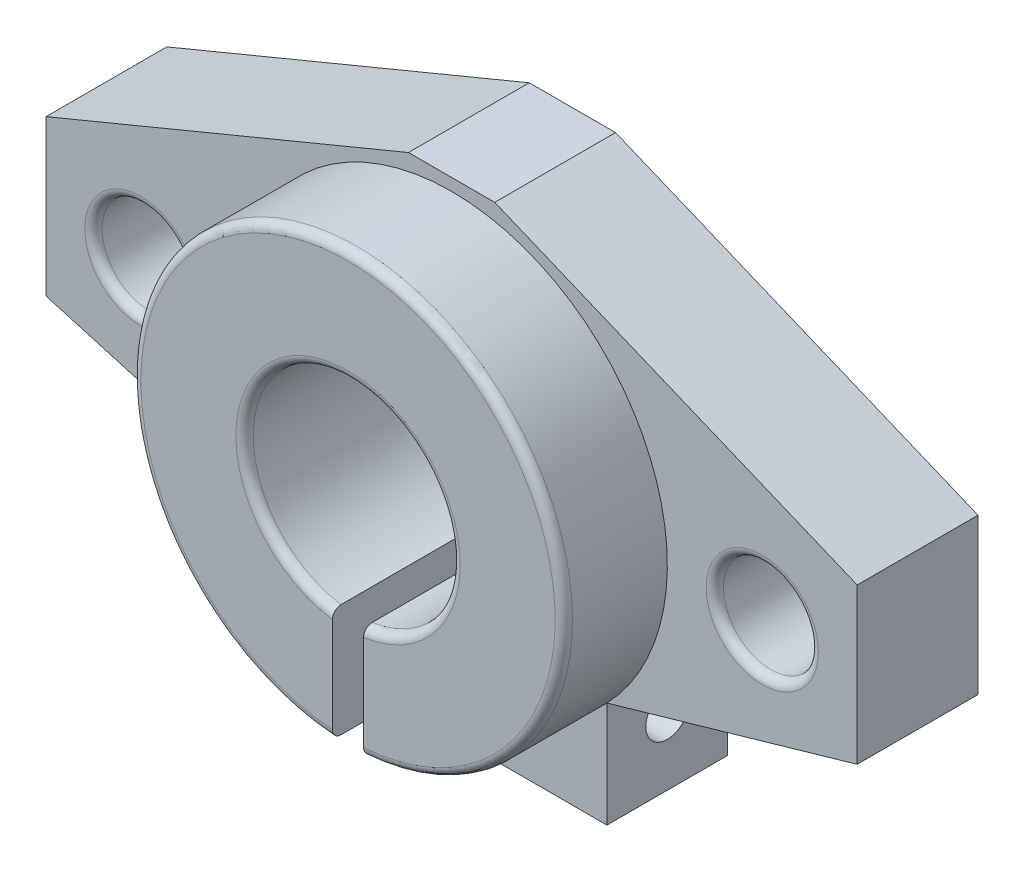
from build123d import *

# Parameters (mm, degrees)
SKETCH1_R           = 2.75
BOSS_EXTRUDE1_DEPTH = 7
BOSS_EXTRUDE2_DEPTH = 13
FILLET1_R           = 0.5
SKETCH2_R           = 1.25
CUT_EXTRUDE1_DEPTH  = 39.004405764


with BuildPart() as part:
    # Sketch1 → Boss-Extrude1 (new body)
    # profile 1 of 4: a face of its own
    with BuildSketch(Plane.XY):
        with BuildLine():
            Line((-2.5, 13.19848481), (-23.5, 4.5))
            Line((-23.5, 4.5), (-23.5, -4.5))
            Line((-23.5, -4.5), (-9, -8.674675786))
            ThreePointArc((-9, -8.674675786), (0, 12.5), (9, -8.674675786))
            Line((9, -8.674675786), (23.5, -4.5))
            Line((23.5, -4.5), (23.5, 4.5))
            Line((23.5, 4.5), (2.5, 13.19848481))
            Line((2.5, 13.19848481), (-2.5, 13.19848481))
        make_face()
        with Locations((-18, 0)):
            Circle(SKETCH1_R, mode=Mode.SUBTRACT)
        with Locations((18, 0)):
            Circle(SKETCH1_R, mode=Mode.SUBTRACT)
    # profile 2 of 4: a face of its own
    with BuildSketch(Plane.XY):
        with BuildLine():
            Line((9, -14.80151519), (9, -8.674675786))
            ThreePointArc((9, -8.674675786), (5.300847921, -11.320380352), (0.9, -12.4675579))
            Line((0.9, -12.4675579), (0.9, -14.80151519))
            Line((0.9, -14.80151519), (9, -14.80151519))
        make_face()
    # profile 3 of 4: a face of its own
    with BuildSketch(Plane.XY):
        with BuildLine():
            ThreePointArc((-0.9, -12.4675579), (-5.300847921, -11.320380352), (-9, -8.674675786))
            Line((-9, -8.674675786), (-9, -14.80151519))
            Line((-9, -14.80151519), (-0.9, -14.80151519))
            Line((-0.9, -14.80151519), (-0.9, -12.4675579))
        make_face()
    # profile 4 of 4: a face of its own
    with BuildSketch(Plane.XY):
        with BuildLine():
            ThreePointArc((9, -8.674675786), (0, 12.5), (-9, -8.674675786))
            ThreePointArc((-9, -8.674675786), (-5.300847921, -11.320380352), (-0.9, -12.4675579))
            Line((-0.9, -12.4675579), (-0.9, -5.93211598))
            ThreePointArc((-0.9, -5.93211598), (-3.911521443, 4.549725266), (6, 0))
            ThreePointArc((6, 0), (4.549725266, -3.911521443), (0.9, -5.93211598))
            Line((0.9, -5.93211598), (0.9, -12.4675579))
            ThreePointArc((0.9, -12.4675579), (5.300847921, -11.320380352), (9, -8.674675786))
        make_face()
    extrude(amount=BOSS_EXTRUDE1_DEPTH)

    # Sketch1_3 → Boss-Extrude2 (add)
    with BuildSketch(Plane.XY):
        with BuildLine():
            ThreePointArc((9, -8.674675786), (0, 12.5), (-9, -8.674675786))
            ThreePointArc((-9, -8.674675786), (-5.300847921, -11.320380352), (-0.9, -12.4675579))
            Line((-0.9, -12.4675579), (-0.9, -5.93211598))
            ThreePointArc((-0.9, -5.93211598), (-3.911521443, 4.549725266), (6, 0))
            ThreePointArc((6, 0), (4.549725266, -3.911521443), (0.9, -5.93211598))
            Line((0.9, -5.93211598), (0.9, -12.4675579))
            ThreePointArc((0.9, -12.4675579), (5.300847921, -11.320380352), (9, -8.674675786))
        make_face()
    extrude(amount=BOSS_EXTRUDE2_DEPTH)

    # Fillet1
    fillet1_edges = [part.edges().sort_by_distance(p)[0] for p in [
        (-20.75, 0, 0),
        (15.25, 0, 0),
        (-3.911521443, 4.549725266, 0),
        (-3.911521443, 4.549725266, 13),
        (4.472022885, 11.67266085, 13),
        (15.25, 0, 7),
        (-20.75, 0, 7),
    ]]
    fillet(fillet1_edges, radius=FILLET1_R)

    # Sketch2 → Cut-Extrude1 (cut, through all)
    with BuildSketch(Plane.ZY.offset(9)):
        with Locations((3.5, -11)):
            Circle(SKETCH2_R)
    extrude(amount=-CUT_EXTRUDE1_DEPTH, mode=Mode.SUBTRACT)


solid = part.part
